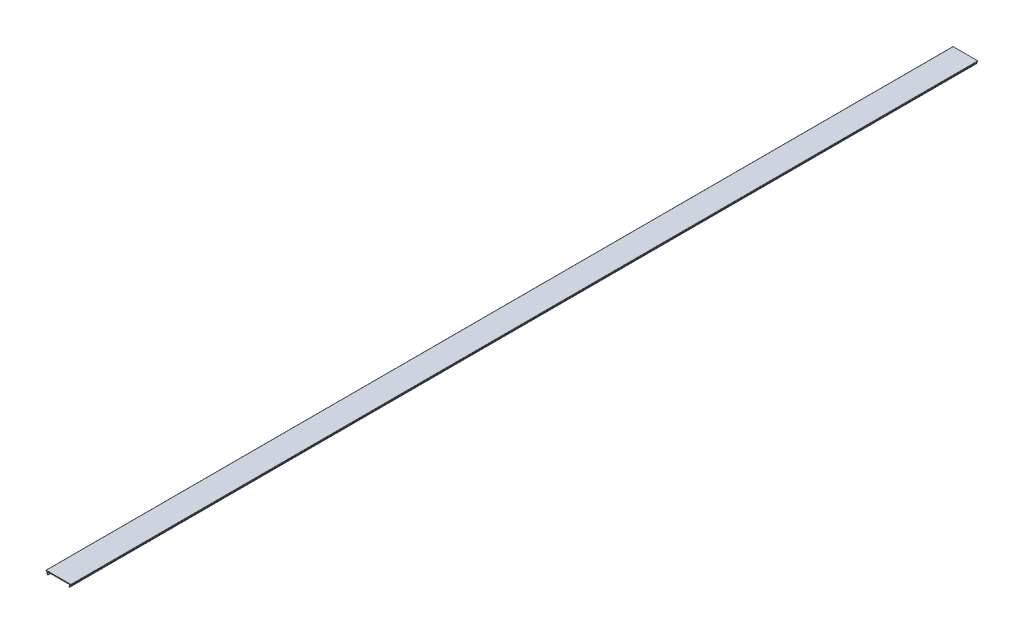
ISO-10303-21;
HEADER;
FILE_DESCRIPTION(('STEP AP214'),'2;1');
FILE_NAME('part.step','',(''),(''),'','','');
FILE_SCHEMA(('AUTOMOTIVE_DESIGN { 1 0 10303 214 1 1 1 1 }'));
ENDSEC;
DATA;
#1=APPLICATION_CONTEXT('core data for automotive mechanical design processes');
#2=APPLICATION_PROTOCOL_DEFINITION('international standard','automotive_design',2000,#1);
#3=PRODUCT_CONTEXT('',#1,'mechanical');
#4=PRODUCT('Part','Part','',(#3));
#5=PRODUCT_RELATED_PRODUCT_CATEGORY('part','',(#4));
#6=PRODUCT_DEFINITION_FORMATION('','',#4);
#7=PRODUCT_DEFINITION_CONTEXT('part definition',#1,'design');
#8=PRODUCT_DEFINITION('design','',#6,#7);
#9=PRODUCT_DEFINITION_SHAPE('','',#8);
#10=(LENGTH_UNIT() NAMED_UNIT(*) SI_UNIT(.MILLI.,.METRE.));
#11=(NAMED_UNIT(*) PLANE_ANGLE_UNIT() SI_UNIT($,.RADIAN.));
#12=(NAMED_UNIT(*) SI_UNIT($,.STERADIAN.) SOLID_ANGLE_UNIT());
#13=UNCERTAINTY_MEASURE_WITH_UNIT(LENGTH_MEASURE(1.E-05),#10,'distance_accuracy_value','');
#14=(GEOMETRIC_REPRESENTATION_CONTEXT(3) GLOBAL_UNCERTAINTY_ASSIGNED_CONTEXT((#13)) GLOBAL_UNIT_ASSIGNED_CONTEXT((#10,
#11,#12)) REPRESENTATION_CONTEXT('',''));
#15=CARTESIAN_POINT('',(0.,0.,0.));
#16=DIRECTION('',(0.,0.,1.));
#17=DIRECTION('',(1.,0.,0.));
#18=AXIS2_PLACEMENT_3D('',#15,#16,#17);
#19=CARTESIAN_POINT('',(20.1,-2.0173731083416,-813.0032));
#20=DIRECTION('',(-0.866025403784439,0.5,0.));
#21=DIRECTION('',(-0.5,-0.866025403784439,0.));
#22=AXIS2_PLACEMENT_3D('',#19,#20,#21);
#23=PLANE('',#22);
#24=DIRECTION('',(0.,0.,1.));
#25=VECTOR('',#24,1.);
#26=CARTESIAN_POINT('',(18.810992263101,-4.24999999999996,-813.0032));
#27=LINE('',#26,#25);
#28=CARTESIAN_POINT('',(18.810992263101,-4.24999999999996,-813.0032));
#29=VERTEX_POINT('',#28);
#30=CARTESIAN_POINT('',(18.810992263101,-4.24999999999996,813.0032));
#31=VERTEX_POINT('',#30);
#32=EDGE_CURVE('E33',#29,#31,#27,.T.);
#33=ORIENTED_EDGE('',*,*,#32,.T.);
#34=DIRECTION('',(-0.5,-0.866025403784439,0.));
#35=VECTOR('',#34,1.);
#36=CARTESIAN_POINT('',(20.1,-2.0173731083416,813.0032));
#37=LINE('',#36,#35);
#38=CARTESIAN_POINT('',(20.1,-2.0173731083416,813.0032));
#39=VERTEX_POINT('',#38);
#40=EDGE_CURVE('E238',#39,#31,#37,.T.);
#41=ORIENTED_EDGE('',*,*,#40,.F.);
#42=DIRECTION('',(0.,0.,1.));
#43=VECTOR('',#42,1.);
#44=CARTESIAN_POINT('',(20.1,-2.0173731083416,-813.0032));
#45=LINE('',#44,#43);
#46=CARTESIAN_POINT('',(20.1,-2.0173731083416,-813.0032));
#47=VERTEX_POINT('',#46);
#48=EDGE_CURVE('E11',#47,#39,#45,.T.);
#49=ORIENTED_EDGE('',*,*,#48,.F.);
#50=DIRECTION('',(-0.5,-0.866025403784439,0.));
#51=VECTOR('',#50,1.);
#52=CARTESIAN_POINT('',(20.1,-2.0173731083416,-813.0032));
#53=LINE('',#52,#51);
#54=EDGE_CURVE('E239',#47,#29,#53,.T.);
#55=ORIENTED_EDGE('',*,*,#54,.T.);
#56=EDGE_LOOP('',(#33,#41,#49,#55));
#57=FACE_BOUND('',#56,.T.);
#58=ADVANCED_FACE('F30',(#57),#23,.T.);
#59=CARTESIAN_POINT('',(19.533955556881,-1.34278760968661,-813.0032));
#60=DIRECTION('',(-0.766044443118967,-0.642787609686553,0.));
#61=DIRECTION('',(0.642787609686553,-0.766044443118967,0.));
#62=AXIS2_PLACEMENT_3D('',#59,#60,#61);
#63=PLANE('',#62);
#64=ORIENTED_EDGE('',*,*,#48,.T.);
#65=DIRECTION('',(0.642787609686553,-0.766044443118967,0.));
#66=VECTOR('',#65,1.);
#67=CARTESIAN_POINT('',(19.533955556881,-1.34278760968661,813.0032));
#68=LINE('',#67,#66);
#69=CARTESIAN_POINT('',(19.533955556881,-1.34278760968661,813.0032));
#70=VERTEX_POINT('',#69);
#71=EDGE_CURVE('E256',#70,#39,#68,.T.);
#72=ORIENTED_EDGE('',*,*,#71,.F.);
#73=DIRECTION('',(0.,0.,1.));
#74=VECTOR('',#73,1.);
#75=CARTESIAN_POINT('',(19.533955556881,-1.34278760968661,-813.0032));
#76=LINE('',#75,#74);
#77=CARTESIAN_POINT('',(19.533955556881,-1.34278760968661,-813.0032));
#78=VERTEX_POINT('',#77);
#79=EDGE_CURVE('E38',#78,#70,#76,.T.);
#80=ORIENTED_EDGE('',*,*,#79,.F.);
#81=DIRECTION('',(0.642787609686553,-0.766044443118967,0.));
#82=VECTOR('',#81,1.);
#83=CARTESIAN_POINT('',(19.533955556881,-1.34278760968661,-813.0032));
#84=LINE('',#83,#82);
#85=EDGE_CURVE('E244',#78,#47,#84,.T.);
#86=ORIENTED_EDGE('',*,*,#85,.T.);
#87=EDGE_LOOP('',(#64,#72,#80,#86));
#88=FACE_BOUND('',#87,.T.);
#89=ADVANCED_FACE('F608',(#88),#63,.T.);
#90=CARTESIAN_POINT('',(20.3,-0.700000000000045,-813.0032));
#91=DIRECTION('',(0.,0.,1.));
#92=DIRECTION('',(1.,0.,0.));
#93=AXIS2_PLACEMENT_3D('',#90,#91,#92);
#94=CYLINDRICAL_SURFACE('',#93,1.00000000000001);
#95=ORIENTED_EDGE('',*,*,#79,.T.);
#96=CARTESIAN_POINT('',(20.3,-0.700000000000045,813.0032));
#97=DIRECTION('',(0.,0.,1.));
#98=DIRECTION('',(1.,0.,0.));
#99=AXIS2_PLACEMENT_3D('',#96,#97,#98);
#100=CIRCLE('',#99,1.00000000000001);
#101=CARTESIAN_POINT('',(19.3,-0.700000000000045,813.0032));
#102=VERTEX_POINT('',#101);
#103=EDGE_CURVE('E341',#102,#70,#100,.T.);
#104=ORIENTED_EDGE('',*,*,#103,.F.);
#105=DIRECTION('',(0.,0.,1.));
#106=VECTOR('',#105,1.);
#107=CARTESIAN_POINT('',(19.3,-0.700000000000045,-813.0032));
#108=LINE('',#107,#106);
#109=CARTESIAN_POINT('',(19.3,-0.700000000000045,-813.0032));
#110=VERTEX_POINT('',#109);
#111=EDGE_CURVE('E435',#110,#102,#108,.T.);
#112=ORIENTED_EDGE('',*,*,#111,.F.);
#113=CARTESIAN_POINT('',(20.3,-0.700000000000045,-813.0032));
#114=DIRECTION('',(0.,0.,1.));
#115=DIRECTION('',(1.,0.,0.));
#116=AXIS2_PLACEMENT_3D('',#113,#114,#115);
#117=CIRCLE('',#116,1.00000000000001);
#118=EDGE_CURVE('E431',#110,#78,#117,.T.);
#119=ORIENTED_EDGE('',*,*,#118,.T.);
#120=EDGE_LOOP('',(#95,#104,#112,#119));
#121=FACE_BOUND('',#120,.T.);
#122=ADVANCED_FACE('F607',(#121),#94,.T.);
#123=CARTESIAN_POINT('',(19.3,0.,-813.0032));
#124=DIRECTION('',(-1.,0.,0.));
#125=DIRECTION('',(0.,0.,1.));
#126=AXIS2_PLACEMENT_3D('',#123,#124,#125);
#127=PLANE('',#126);
#128=ORIENTED_EDGE('',*,*,#111,.T.);
#129=DIRECTION('',(0.,-1.,0.));
#130=VECTOR('',#129,1.);
#131=CARTESIAN_POINT('',(19.3,0.,813.0032));
#132=LINE('',#131,#130);
#133=CARTESIAN_POINT('',(19.3,0.,813.0032));
#134=VERTEX_POINT('',#133);
#135=EDGE_CURVE('E338',#134,#102,#132,.T.);
#136=ORIENTED_EDGE('',*,*,#135,.F.);
#137=DIRECTION('',(0.,0.,1.));
#138=VECTOR('',#137,1.);
#139=CARTESIAN_POINT('',(19.3,0.,-813.0032));
#140=LINE('',#139,#138);
#141=CARTESIAN_POINT('',(19.3,0.,-813.0032));
#142=VERTEX_POINT('',#141);
#143=EDGE_CURVE('E437',#142,#134,#140,.T.);
#144=ORIENTED_EDGE('',*,*,#143,.F.);
#145=DIRECTION('',(0.,-1.,0.));
#146=VECTOR('',#145,1.);
#147=CARTESIAN_POINT('',(19.3,0.,-813.0032));
#148=LINE('',#147,#146);
#149=EDGE_CURVE('E428',#142,#110,#148,.T.);
#150=ORIENTED_EDGE('',*,*,#149,.T.);
#151=EDGE_LOOP('',(#128,#136,#144,#150));
#152=FACE_BOUND('',#151,.T.);
#153=ADVANCED_FACE('F603',(#152),#127,.T.);
#154=CARTESIAN_POINT('',(17.5,0.,-813.0032));
#155=DIRECTION('',(0.,-1.,0.));
#156=DIRECTION('',(1.,0.,0.));
#157=AXIS2_PLACEMENT_3D('',#154,#155,#156);
#158=PLANE('',#157);
#159=ORIENTED_EDGE('',*,*,#143,.T.);
#160=DIRECTION('',(1.,0.,0.));
#161=VECTOR('',#160,1.);
#162=CARTESIAN_POINT('',(17.5,0.,813.0032));
#163=LINE('',#162,#161);
#164=CARTESIAN_POINT('',(17.5,0.,813.0032));
#165=VERTEX_POINT('',#164);
#166=EDGE_CURVE('E335',#165,#134,#163,.T.);
#167=ORIENTED_EDGE('',*,*,#166,.F.);
#168=DIRECTION('',(0.,0.,1.));
#169=VECTOR('',#168,1.);
#170=CARTESIAN_POINT('',(17.5,0.,-813.0032));
#171=LINE('',#170,#169);
#172=CARTESIAN_POINT('',(17.5,0.,-813.0032));
#173=VERTEX_POINT('',#172);
#174=EDGE_CURVE('E439',#173,#165,#171,.T.);
#175=ORIENTED_EDGE('',*,*,#174,.F.);
#176=DIRECTION('',(1.,0.,0.));
#177=VECTOR('',#176,1.);
#178=CARTESIAN_POINT('',(17.5,0.,-813.0032));
#179=LINE('',#178,#177);
#180=EDGE_CURVE('E425',#173,#142,#179,.T.);
#181=ORIENTED_EDGE('',*,*,#180,.T.);
#182=EDGE_LOOP('',(#159,#167,#175,#181));
#183=FACE_BOUND('',#182,.T.);
#184=ADVANCED_FACE('F598',(#183),#158,.T.);
#185=CARTESIAN_POINT('',(17.,-0.500000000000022,-813.0032));
#186=DIRECTION('',(0.70710678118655,-0.707106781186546,0.));
#187=DIRECTION('',(0.707106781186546,0.70710678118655,0.));
#188=AXIS2_PLACEMENT_3D('',#185,#186,#187);
#189=PLANE('',#188);
#190=ORIENTED_EDGE('',*,*,#174,.T.);
#191=DIRECTION('',(0.707106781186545,0.70710678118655,0.));
#192=VECTOR('',#191,1.);
#193=CARTESIAN_POINT('',(17.,-0.500000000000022,813.0032));
#194=LINE('',#193,#192);
#195=CARTESIAN_POINT('',(17.,-0.500000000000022,813.0032));
#196=VERTEX_POINT('',#195);
#197=EDGE_CURVE('E332',#196,#165,#194,.T.);
#198=ORIENTED_EDGE('',*,*,#197,.F.);
#199=DIRECTION('',(0.,0.,1.));
#200=VECTOR('',#199,1.);
#201=CARTESIAN_POINT('',(17.,-0.500000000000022,-813.0032));
#202=LINE('',#201,#200);
#203=CARTESIAN_POINT('',(17.,-0.500000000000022,-813.0032));
#204=VERTEX_POINT('',#203);
#205=EDGE_CURVE('E441',#204,#196,#202,.T.);
#206=ORIENTED_EDGE('',*,*,#205,.F.);
#207=DIRECTION('',(0.707106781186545,0.70710678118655,0.));
#208=VECTOR('',#207,1.);
#209=CARTESIAN_POINT('',(17.,-0.500000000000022,-813.0032));
#210=LINE('',#209,#208);
#211=EDGE_CURVE('E422',#204,#173,#210,.T.);
#212=ORIENTED_EDGE('',*,*,#211,.T.);
#213=EDGE_LOOP('',(#190,#198,#206,#212));
#214=FACE_BOUND('',#213,.T.);
#215=ADVANCED_FACE('F596',(#214),#189,.T.);
#216=CARTESIAN_POINT('',(-17.,-0.500000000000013,-813.0032));
#217=DIRECTION('',(0.,-1.,0.));
#218=DIRECTION('',(1.,0.,0.));
#219=AXIS2_PLACEMENT_3D('',#216,#217,#218);
#220=PLANE('',#219);
#221=ORIENTED_EDGE('',*,*,#205,.T.);
#222=DIRECTION('',(1.,0.,0.));
#223=VECTOR('',#222,1.);
#224=CARTESIAN_POINT('',(-17.,-0.500000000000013,813.0032));
#225=LINE('',#224,#223);
#226=CARTESIAN_POINT('',(-17.,-0.500000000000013,813.0032));
#227=VERTEX_POINT('',#226);
#228=EDGE_CURVE('E329',#227,#196,#225,.T.);
#229=ORIENTED_EDGE('',*,*,#228,.F.);
#230=DIRECTION('',(0.,0.,1.));
#231=VECTOR('',#230,1.);
#232=CARTESIAN_POINT('',(-17.,-0.500000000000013,-813.0032));
#233=LINE('',#232,#231);
#234=CARTESIAN_POINT('',(-17.,-0.500000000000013,-813.0032));
#235=VERTEX_POINT('',#234);
#236=EDGE_CURVE('E443',#235,#227,#233,.T.);
#237=ORIENTED_EDGE('',*,*,#236,.F.);
#238=DIRECTION('',(1.,0.,0.));
#239=VECTOR('',#238,1.);
#240=CARTESIAN_POINT('',(-17.,-0.500000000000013,-813.0032));
#241=LINE('',#240,#239);
#242=EDGE_CURVE('E419',#235,#204,#241,.T.);
#243=ORIENTED_EDGE('',*,*,#242,.T.);
#244=EDGE_LOOP('',(#221,#229,#237,#243));
#245=FACE_BOUND('',#244,.T.);
#246=ADVANCED_FACE('F591',(#245),#220,.T.);
#247=CARTESIAN_POINT('',(-17.5,0.,-813.0032));
#248=DIRECTION('',(-0.70710678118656,-0.707106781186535,0.));
#249=DIRECTION('',(0.707106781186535,-0.70710678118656,0.));
#250=AXIS2_PLACEMENT_3D('',#247,#248,#249);
#251=PLANE('',#250);
#252=ORIENTED_EDGE('',*,*,#236,.T.);
#253=DIRECTION('',(0.707106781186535,-0.70710678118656,0.));
#254=VECTOR('',#253,1.);
#255=CARTESIAN_POINT('',(-17.5,0.,813.0032));
#256=LINE('',#255,#254);
#257=CARTESIAN_POINT('',(-17.5,0.,813.0032));
#258=VERTEX_POINT('',#257);
#259=EDGE_CURVE('E326',#258,#227,#256,.T.);
#260=ORIENTED_EDGE('',*,*,#259,.F.);
#261=DIRECTION('',(0.,0.,1.));
#262=VECTOR('',#261,1.);
#263=CARTESIAN_POINT('',(-17.5,0.,-813.0032));
#264=LINE('',#263,#262);
#265=CARTESIAN_POINT('',(-17.5,0.,-813.0032));
#266=VERTEX_POINT('',#265);
#267=EDGE_CURVE('E445',#266,#258,#264,.T.);
#268=ORIENTED_EDGE('',*,*,#267,.F.);
#269=DIRECTION('',(0.707106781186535,-0.70710678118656,0.));
#270=VECTOR('',#269,1.);
#271=CARTESIAN_POINT('',(-17.5,0.,-813.0032));
#272=LINE('',#271,#270);
#273=EDGE_CURVE('E416',#266,#235,#272,.T.);
#274=ORIENTED_EDGE('',*,*,#273,.T.);
#275=EDGE_LOOP('',(#252,#260,#268,#274));
#276=FACE_BOUND('',#275,.T.);
#277=ADVANCED_FACE('F586',(#276),#251,.T.);
#278=CARTESIAN_POINT('',(-19.3,0.,-813.0032));
#279=DIRECTION('',(0.,-1.,0.));
#280=DIRECTION('',(1.,0.,0.));
#281=AXIS2_PLACEMENT_3D('',#278,#279,#280);
#282=PLANE('',#281);
#283=ORIENTED_EDGE('',*,*,#267,.T.);
#284=DIRECTION('',(1.,0.,0.));
#285=VECTOR('',#284,1.);
#286=CARTESIAN_POINT('',(-19.3,0.,813.0032));
#287=LINE('',#286,#285);
#288=CARTESIAN_POINT('',(-19.3,0.,813.0032));
#289=VERTEX_POINT('',#288);
#290=EDGE_CURVE('E323',#289,#258,#287,.T.);
#291=ORIENTED_EDGE('',*,*,#290,.F.);
#292=DIRECTION('',(0.,0.,1.));
#293=VECTOR('',#292,1.);
#294=CARTESIAN_POINT('',(-19.3,0.,-813.0032));
#295=LINE('',#294,#293);
#296=CARTESIAN_POINT('',(-19.3,0.,-813.0032));
#297=VERTEX_POINT('',#296);
#298=EDGE_CURVE('E447',#297,#289,#295,.T.);
#299=ORIENTED_EDGE('',*,*,#298,.F.);
#300=DIRECTION('',(1.,0.,0.));
#301=VECTOR('',#300,1.);
#302=CARTESIAN_POINT('',(-19.3,0.,-813.0032));
#303=LINE('',#302,#301);
#304=EDGE_CURVE('E413',#297,#266,#303,.T.);
#305=ORIENTED_EDGE('',*,*,#304,.T.);
#306=EDGE_LOOP('',(#283,#291,#299,#305));
#307=FACE_BOUND('',#306,.T.);
#308=ADVANCED_FACE('F584',(#307),#282,.T.);
#309=CARTESIAN_POINT('',(-19.3,-0.700000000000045,-813.0032));
#310=DIRECTION('',(1.,0.,0.));
#311=DIRECTION('',(0.,1.,0.));
#312=AXIS2_PLACEMENT_3D('',#309,#310,#311);
#313=PLANE('',#312);
#314=ORIENTED_EDGE('',*,*,#298,.T.);
#315=DIRECTION('',(0.,1.,0.));
#316=VECTOR('',#315,1.);
#317=CARTESIAN_POINT('',(-19.3,-0.700000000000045,813.0032));
#318=LINE('',#317,#316);
#319=CARTESIAN_POINT('',(-19.3,-0.700000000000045,813.0032));
#320=VERTEX_POINT('',#319);
#321=EDGE_CURVE('E320',#320,#289,#318,.T.);
#322=ORIENTED_EDGE('',*,*,#321,.F.);
#323=DIRECTION('',(0.,0.,1.));
#324=VECTOR('',#323,1.);
#325=CARTESIAN_POINT('',(-19.3,-0.700000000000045,-813.0032));
#326=LINE('',#325,#324);
#327=CARTESIAN_POINT('',(-19.3,-0.700000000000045,-813.0032));
#328=VERTEX_POINT('',#327);
#329=EDGE_CURVE('E449',#328,#320,#326,.T.);
#330=ORIENTED_EDGE('',*,*,#329,.F.);
#331=DIRECTION('',(0.,1.,0.));
#332=VECTOR('',#331,1.);
#333=CARTESIAN_POINT('',(-19.3,-0.700000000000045,-813.0032));
#334=LINE('',#333,#332);
#335=EDGE_CURVE('E410',#328,#297,#334,.T.);
#336=ORIENTED_EDGE('',*,*,#335,.T.);
#337=EDGE_LOOP('',(#314,#322,#330,#336));
#338=FACE_BOUND('',#337,.T.);
#339=ADVANCED_FACE('F579',(#338),#313,.T.);
#340=CARTESIAN_POINT('',(-20.3,-0.700000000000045,-813.0032));
#341=DIRECTION('',(0.,0.,1.));
#342=DIRECTION('',(1.,0.,0.));
#343=AXIS2_PLACEMENT_3D('',#340,#341,#342);
#344=CYLINDRICAL_SURFACE('',#343,0.999999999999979);
#345=ORIENTED_EDGE('',*,*,#329,.T.);
#346=CARTESIAN_POINT('',(-20.3,-0.700000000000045,813.0032));
#347=DIRECTION('',(0.,0.,1.));
#348=DIRECTION('',(1.,0.,0.));
#349=AXIS2_PLACEMENT_3D('',#346,#347,#348);
#350=CIRCLE('',#349,0.999999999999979);
#351=CARTESIAN_POINT('',(-19.533955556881,-1.34278760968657,813.0032));
#352=VERTEX_POINT('',#351);
#353=EDGE_CURVE('E317',#352,#320,#350,.T.);
#354=ORIENTED_EDGE('',*,*,#353,.F.);
#355=DIRECTION('',(0.,0.,1.));
#356=VECTOR('',#355,1.);
#357=CARTESIAN_POINT('',(-19.533955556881,-1.34278760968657,-813.0032));
#358=LINE('',#357,#356);
#359=CARTESIAN_POINT('',(-19.533955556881,-1.34278760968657,-813.0032));
#360=VERTEX_POINT('',#359);
#361=EDGE_CURVE('E451',#360,#352,#358,.T.);
#362=ORIENTED_EDGE('',*,*,#361,.F.);
#363=CARTESIAN_POINT('',(-20.3,-0.700000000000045,-813.0032));
#364=DIRECTION('',(0.,0.,1.));
#365=DIRECTION('',(1.,0.,0.));
#366=AXIS2_PLACEMENT_3D('',#363,#364,#365);
#367=CIRCLE('',#366,0.999999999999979);
#368=EDGE_CURVE('E407',#360,#328,#367,.T.);
#369=ORIENTED_EDGE('',*,*,#368,.T.);
#370=EDGE_LOOP('',(#345,#354,#362,#369));
#371=FACE_BOUND('',#370,.T.);
#372=ADVANCED_FACE('F574',(#371),#344,.T.);
#373=CARTESIAN_POINT('',(-20.1,-2.0173731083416,-813.0032));
#374=DIRECTION('',(0.766044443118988,-0.642787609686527,0.));
#375=DIRECTION('',(0.642787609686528,0.766044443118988,0.));
#376=AXIS2_PLACEMENT_3D('',#373,#374,#375);
#377=PLANE('',#376);
#378=ORIENTED_EDGE('',*,*,#361,.T.);
#379=DIRECTION('',(0.642787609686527,0.766044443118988,0.));
#380=VECTOR('',#379,1.);
#381=CARTESIAN_POINT('',(-20.1,-2.0173731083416,813.0032));
#382=LINE('',#381,#380);
#383=CARTESIAN_POINT('',(-20.1,-2.0173731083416,813.0032));
#384=VERTEX_POINT('',#383);
#385=EDGE_CURVE('E314',#384,#352,#382,.T.);
#386=ORIENTED_EDGE('',*,*,#385,.F.);
#387=DIRECTION('',(0.,0.,1.));
#388=VECTOR('',#387,1.);
#389=CARTESIAN_POINT('',(-20.1,-2.0173731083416,-813.0032));
#390=LINE('',#389,#388);
#391=CARTESIAN_POINT('',(-20.1,-2.0173731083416,-813.0032));
#392=VERTEX_POINT('',#391);
#393=EDGE_CURVE('E453',#392,#384,#390,.T.);
#394=ORIENTED_EDGE('',*,*,#393,.F.);
#395=DIRECTION('',(0.642787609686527,0.766044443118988,0.));
#396=VECTOR('',#395,1.);
#397=CARTESIAN_POINT('',(-20.1,-2.0173731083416,-813.0032));
#398=LINE('',#397,#396);
#399=EDGE_CURVE('E404',#392,#360,#398,.T.);
#400=ORIENTED_EDGE('',*,*,#399,.T.);
#401=EDGE_LOOP('',(#378,#386,#394,#400));
#402=FACE_BOUND('',#401,.T.);
#403=ADVANCED_FACE('F572',(#402),#377,.T.);
#404=CARTESIAN_POINT('',(-18.810992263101,-4.24999999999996,-813.0032));
#405=DIRECTION('',(0.866025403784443,0.499999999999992,0.));
#406=DIRECTION('',(-0.499999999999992,0.866025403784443,0.));
#407=AXIS2_PLACEMENT_3D('',#404,#405,#406);
#408=PLANE('',#407);
#409=ORIENTED_EDGE('',*,*,#393,.T.);
#410=DIRECTION('',(-0.499999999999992,0.866025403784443,0.));
#411=VECTOR('',#410,1.);
#412=CARTESIAN_POINT('',(-18.810992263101,-4.24999999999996,813.0032));
#413=LINE('',#412,#411);
#414=CARTESIAN_POINT('',(-18.810992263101,-4.24999999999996,813.0032));
#415=VERTEX_POINT('',#414);
#416=EDGE_CURVE('E311',#415,#384,#413,.T.);
#417=ORIENTED_EDGE('',*,*,#416,.F.);
#418=DIRECTION('',(0.,0.,1.));
#419=VECTOR('',#418,1.);
#420=CARTESIAN_POINT('',(-18.810992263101,-4.24999999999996,-813.0032));
#421=LINE('',#420,#419);
#422=CARTESIAN_POINT('',(-18.810992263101,-4.24999999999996,-813.0032));
#423=VERTEX_POINT('',#422);
#424=EDGE_CURVE('E455',#423,#415,#421,.T.);
#425=ORIENTED_EDGE('',*,*,#424,.F.);
#426=DIRECTION('',(-0.499999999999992,0.866025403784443,0.));
#427=VECTOR('',#426,1.);
#428=CARTESIAN_POINT('',(-18.810992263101,-4.24999999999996,-813.0032));
#429=LINE('',#428,#427);
#430=EDGE_CURVE('E401',#423,#392,#429,.T.);
#431=ORIENTED_EDGE('',*,*,#430,.T.);
#432=EDGE_LOOP('',(#409,#417,#425,#431));
#433=FACE_BOUND('',#432,.T.);
#434=ADVANCED_FACE('F567',(#433),#408,.T.);
#435=CARTESIAN_POINT('',(-19.2440049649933,-4.49999999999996,-813.0032));
#436=DIRECTION('',(0.,0.,1.));
#437=DIRECTION('',(1.,0.,0.));
#438=AXIS2_PLACEMENT_3D('',#435,#436,#437);
#439=CYLINDRICAL_SURFACE('',#438,0.500000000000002);
#440=ORIENTED_EDGE('',*,*,#424,.T.);
#441=CARTESIAN_POINT('',(-19.2440049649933,-4.49999999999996,813.0032));
#442=DIRECTION('',(0.,0.,1.));
#443=DIRECTION('',(1.,0.,0.));
#444=AXIS2_PLACEMENT_3D('',#441,#442,#443);
#445=CIRCLE('',#444,0.500000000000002);
#446=CARTESIAN_POINT('',(-19.6770176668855,-4.74999999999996,813.0032));
#447=VERTEX_POINT('',#446);
#448=EDGE_CURVE('E308',#447,#415,#445,.T.);
#449=ORIENTED_EDGE('',*,*,#448,.F.);
#450=DIRECTION('',(0.,0.,1.));
#451=VECTOR('',#450,1.);
#452=CARTESIAN_POINT('',(-19.6770176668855,-4.74999999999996,-813.0032));
#453=LINE('',#452,#451);
#454=CARTESIAN_POINT('',(-19.6770176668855,-4.74999999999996,-813.0032));
#455=VERTEX_POINT('',#454);
#456=EDGE_CURVE('E457',#455,#447,#453,.T.);
#457=ORIENTED_EDGE('',*,*,#456,.F.);
#458=CARTESIAN_POINT('',(-19.2440049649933,-4.49999999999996,-813.0032));
#459=DIRECTION('',(0.,0.,1.));
#460=DIRECTION('',(1.,0.,0.));
#461=AXIS2_PLACEMENT_3D('',#458,#459,#460);
#462=CIRCLE('',#461,0.500000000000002);
#463=EDGE_CURVE('E398',#455,#423,#462,.T.);
#464=ORIENTED_EDGE('',*,*,#463,.T.);
#465=EDGE_LOOP('',(#440,#449,#457,#464));
#466=FACE_BOUND('',#465,.T.);
#467=ADVANCED_FACE('F562',(#466),#439,.T.);
#468=CARTESIAN_POINT('',(-20.9660254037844,-2.51737310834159,-813.0032));
#469=DIRECTION('',(-0.866025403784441,-0.499999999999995,0.));
#470=DIRECTION('',(0.499999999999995,-0.866025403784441,0.));
#471=AXIS2_PLACEMENT_3D('',#468,#469,#470);
#472=PLANE('',#471);
#473=ORIENTED_EDGE('',*,*,#456,.T.);
#474=DIRECTION('',(0.499999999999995,-0.866025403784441,0.));
#475=VECTOR('',#474,1.);
#476=CARTESIAN_POINT('',(-20.9660254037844,-2.51737310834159,813.0032));
#477=LINE('',#476,#475);
#478=CARTESIAN_POINT('',(-20.9660254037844,-2.51737310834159,813.0032));
#479=VERTEX_POINT('',#478);
#480=EDGE_CURVE('E305',#479,#447,#477,.T.);
#481=ORIENTED_EDGE('',*,*,#480,.F.);
#482=DIRECTION('',(0.,0.,1.));
#483=VECTOR('',#482,1.);
#484=CARTESIAN_POINT('',(-20.9660254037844,-2.51737310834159,-813.0032));
#485=LINE('',#484,#483);
#486=CARTESIAN_POINT('',(-20.9660254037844,-2.51737310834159,-813.0032));
#487=VERTEX_POINT('',#486);
#488=EDGE_CURVE('E459',#487,#479,#485,.T.);
#489=ORIENTED_EDGE('',*,*,#488,.F.);
#490=DIRECTION('',(0.499999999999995,-0.866025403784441,0.));
#491=VECTOR('',#490,1.);
#492=CARTESIAN_POINT('',(-20.9660254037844,-2.51737310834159,-813.0032));
#493=LINE('',#492,#491);
#494=EDGE_CURVE('E395',#487,#455,#493,.T.);
#495=ORIENTED_EDGE('',*,*,#494,.T.);
#496=EDGE_LOOP('',(#473,#481,#489,#495));
#497=FACE_BOUND('',#496,.T.);
#498=ADVANCED_FACE('F560',(#497),#472,.T.);
#499=CARTESIAN_POINT('',(-20.1,-2.0173731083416,-813.0032));
#500=DIRECTION('',(0.,0.,1.));
#501=DIRECTION('',(1.,0.,0.));
#502=AXIS2_PLACEMENT_3D('',#499,#500,#501);
#503=CYLINDRICAL_SURFACE('',#502,0.999999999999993);
#504=ORIENTED_EDGE('',*,*,#488,.T.);
#505=CARTESIAN_POINT('',(-20.1,-2.0173731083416,813.0032));
#506=DIRECTION('',(0.,0.,1.));
#507=DIRECTION('',(1.,0.,0.));
#508=AXIS2_PLACEMENT_3D('',#505,#506,#507);
#509=CIRCLE('',#508,0.999999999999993);
#510=CARTESIAN_POINT('',(-20.866044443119,-1.37458549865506,813.0032));
#511=VERTEX_POINT('',#510);
#512=EDGE_CURVE('E302',#511,#479,#509,.T.);
#513=ORIENTED_EDGE('',*,*,#512,.F.);
#514=DIRECTION('',(0.,0.,1.));
#515=VECTOR('',#514,1.);
#516=CARTESIAN_POINT('',(-20.866044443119,-1.37458549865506,-813.0032));
#517=LINE('',#516,#515);
#518=CARTESIAN_POINT('',(-20.866044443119,-1.37458549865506,-813.0032));
#519=VERTEX_POINT('',#518);
#520=EDGE_CURVE('E461',#519,#511,#517,.T.);
#521=ORIENTED_EDGE('',*,*,#520,.F.);
#522=CARTESIAN_POINT('',(-20.1,-2.0173731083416,-813.0032));
#523=DIRECTION('',(0.,0.,1.));
#524=DIRECTION('',(1.,0.,0.));
#525=AXIS2_PLACEMENT_3D('',#522,#523,#524);
#526=CIRCLE('',#525,0.999999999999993);
#527=EDGE_CURVE('E392',#519,#487,#526,.T.);
#528=ORIENTED_EDGE('',*,*,#527,.T.);
#529=EDGE_LOOP('',(#504,#513,#521,#528));
#530=FACE_BOUND('',#529,.T.);
#531=ADVANCED_FACE('F555',(#530),#503,.T.);
#532=CARTESIAN_POINT('',(-20.3,-0.700000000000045,-813.0032));
#533=DIRECTION('',(-0.766044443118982,0.642787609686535,0.));
#534=DIRECTION('',(-0.642787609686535,-0.766044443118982,0.));
#535=AXIS2_PLACEMENT_3D('',#532,#533,#534);
#536=PLANE('',#535);
#537=ORIENTED_EDGE('',*,*,#520,.T.);
#538=DIRECTION('',(-0.642787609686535,-0.766044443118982,0.));
#539=VECTOR('',#538,1.);
#540=CARTESIAN_POINT('',(-20.3,-0.700000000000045,813.0032));
#541=LINE('',#540,#539);
#542=CARTESIAN_POINT('',(-20.3,-0.700000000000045,813.0032));
#543=VERTEX_POINT('',#542);
#544=EDGE_CURVE('E299',#543,#511,#541,.T.);
#545=ORIENTED_EDGE('',*,*,#544,.F.);
#546=DIRECTION('',(0.,0.,1.));
#547=VECTOR('',#546,1.);
#548=CARTESIAN_POINT('',(-20.3,-0.700000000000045,-813.0032));
#549=LINE('',#548,#547);
#550=CARTESIAN_POINT('',(-20.3,-0.700000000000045,-813.0032));
#551=VERTEX_POINT('',#550);
#552=EDGE_CURVE('E463',#551,#543,#549,.T.);
#553=ORIENTED_EDGE('',*,*,#552,.F.);
#554=DIRECTION('',(-0.642787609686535,-0.766044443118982,0.));
#555=VECTOR('',#554,1.);
#556=CARTESIAN_POINT('',(-20.3,-0.700000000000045,-813.0032));
#557=LINE('',#556,#555);
#558=EDGE_CURVE('E389',#551,#519,#557,.T.);
#559=ORIENTED_EDGE('',*,*,#558,.T.);
#560=EDGE_LOOP('',(#537,#545,#553,#559));
#561=FACE_BOUND('',#560,.T.);
#562=ADVANCED_FACE('F550',(#561),#536,.T.);
#563=CARTESIAN_POINT('',(-20.3,0.,-813.0032));
#564=DIRECTION('',(-1.,0.,0.));
#565=DIRECTION('',(0.,0.,1.));
#566=AXIS2_PLACEMENT_3D('',#563,#564,#565);
#567=PLANE('',#566);
#568=ORIENTED_EDGE('',*,*,#552,.T.);
#569=DIRECTION('',(0.,-1.,0.));
#570=VECTOR('',#569,1.);
#571=CARTESIAN_POINT('',(-20.3,0.,813.0032));
#572=LINE('',#571,#570);
#573=CARTESIAN_POINT('',(-20.3,0.,813.0032));
#574=VERTEX_POINT('',#573);
#575=EDGE_CURVE('E296',#574,#543,#572,.T.);
#576=ORIENTED_EDGE('',*,*,#575,.F.);
#577=DIRECTION('',(0.,0.,1.));
#578=VECTOR('',#577,1.);
#579=CARTESIAN_POINT('',(-20.3,0.,-813.0032));
#580=LINE('',#579,#578);
#581=CARTESIAN_POINT('',(-20.3,0.,-813.0032));
#582=VERTEX_POINT('',#581);
#583=EDGE_CURVE('E465',#582,#574,#580,.T.);
#584=ORIENTED_EDGE('',*,*,#583,.F.);
#585=DIRECTION('',(0.,-1.,0.));
#586=VECTOR('',#585,1.);
#587=CARTESIAN_POINT('',(-20.3,0.,-813.0032));
#588=LINE('',#587,#586);
#589=EDGE_CURVE('E386',#582,#551,#588,.T.);
#590=ORIENTED_EDGE('',*,*,#589,.T.);
#591=EDGE_LOOP('',(#568,#576,#584,#590));
#592=FACE_BOUND('',#591,.T.);
#593=ADVANCED_FACE('F548',(#592),#567,.T.);
#594=CARTESIAN_POINT('',(-22.3,0.,-813.0032));
#595=DIRECTION('',(0.,-1.,0.));
#596=DIRECTION('',(1.,0.,0.));
#597=AXIS2_PLACEMENT_3D('',#594,#595,#596);
#598=PLANE('',#597);
#599=ORIENTED_EDGE('',*,*,#583,.T.);
#600=DIRECTION('',(1.,0.,0.));
#601=VECTOR('',#600,1.);
#602=CARTESIAN_POINT('',(-22.3,0.,813.0032));
#603=LINE('',#602,#601);
#604=CARTESIAN_POINT('',(-22.3,0.,813.0032));
#605=VERTEX_POINT('',#604);
#606=EDGE_CURVE('E293',#605,#574,#603,.T.);
#607=ORIENTED_EDGE('',*,*,#606,.F.);
#608=DIRECTION('',(0.,0.,1.));
#609=VECTOR('',#608,1.);
#610=CARTESIAN_POINT('',(-22.3,0.,-813.0032));
#611=LINE('',#610,#609);
#612=CARTESIAN_POINT('',(-22.3,0.,-813.0032));
#613=VERTEX_POINT('',#612);
#614=EDGE_CURVE('E467',#613,#605,#611,.T.);
#615=ORIENTED_EDGE('',*,*,#614,.F.);
#616=DIRECTION('',(1.,0.,0.));
#617=VECTOR('',#616,1.);
#618=CARTESIAN_POINT('',(-22.3,0.,-813.0032));
#619=LINE('',#618,#617);
#620=EDGE_CURVE('E383',#613,#582,#619,.T.);
#621=ORIENTED_EDGE('',*,*,#620,.T.);
#622=EDGE_LOOP('',(#599,#607,#615,#621));
#623=FACE_BOUND('',#622,.T.);
#624=ADVANCED_FACE('F543',(#623),#598,.T.);
#625=CARTESIAN_POINT('',(-22.3,0.200000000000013,-813.0032));
#626=DIRECTION('',(0.,0.,1.));
#627=DIRECTION('',(1.,0.,0.));
#628=AXIS2_PLACEMENT_3D('',#625,#626,#627);
#629=CYLINDRICAL_SURFACE('',#628,0.200000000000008);
#630=ORIENTED_EDGE('',*,*,#614,.T.);
#631=CARTESIAN_POINT('',(-22.3,0.200000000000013,813.0032));
#632=DIRECTION('',(0.,0.,1.));
#633=DIRECTION('',(1.,0.,0.));
#634=AXIS2_PLACEMENT_3D('',#631,#632,#633);
#635=CIRCLE('',#634,0.200000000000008);
#636=CARTESIAN_POINT('',(-22.5,0.200000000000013,813.0032));
#637=VERTEX_POINT('',#636);
#638=EDGE_CURVE('E290',#637,#605,#635,.T.);
#639=ORIENTED_EDGE('',*,*,#638,.F.);
#640=DIRECTION('',(0.,0.,1.));
#641=VECTOR('',#640,1.);
#642=CARTESIAN_POINT('',(-22.5,0.200000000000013,-813.0032));
#643=LINE('',#642,#641);
#644=CARTESIAN_POINT('',(-22.5,0.200000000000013,-813.0032));
#645=VERTEX_POINT('',#644);
#646=EDGE_CURVE('E469',#645,#637,#643,.T.);
#647=ORIENTED_EDGE('',*,*,#646,.F.);
#648=CARTESIAN_POINT('',(-22.3,0.200000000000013,-813.0032));
#649=DIRECTION('',(0.,0.,1.));
#650=DIRECTION('',(1.,0.,0.));
#651=AXIS2_PLACEMENT_3D('',#648,#649,#650);
#652=CIRCLE('',#651,0.200000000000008);
#653=EDGE_CURVE('E380',#645,#613,#652,.T.);
#654=ORIENTED_EDGE('',*,*,#653,.T.);
#655=EDGE_LOOP('',(#630,#639,#647,#654));
#656=FACE_BOUND('',#655,.T.);
#657=ADVANCED_FACE('F538',(#656),#629,.T.);
#658=CARTESIAN_POINT('',(-22.5,0.500000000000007,-813.0032));
#659=DIRECTION('',(-1.,0.,0.));
#660=DIRECTION('',(0.,0.,1.));
#661=AXIS2_PLACEMENT_3D('',#658,#659,#660);
#662=PLANE('',#661);
#663=ORIENTED_EDGE('',*,*,#646,.T.);
#664=DIRECTION('',(0.,-1.,0.));
#665=VECTOR('',#664,1.);
#666=CARTESIAN_POINT('',(-22.5,0.500000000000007,813.0032));
#667=LINE('',#666,#665);
#668=CARTESIAN_POINT('',(-22.5,0.500000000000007,813.0032));
#669=VERTEX_POINT('',#668);
#670=EDGE_CURVE('E287',#669,#637,#667,.T.);
#671=ORIENTED_EDGE('',*,*,#670,.F.);
#672=DIRECTION('',(0.,0.,1.));
#673=VECTOR('',#672,1.);
#674=CARTESIAN_POINT('',(-22.5,0.500000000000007,-813.0032));
#675=LINE('',#674,#673);
#676=CARTESIAN_POINT('',(-22.5,0.500000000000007,-813.0032));
#677=VERTEX_POINT('',#676);
#678=EDGE_CURVE('E471',#677,#669,#675,.T.);
#679=ORIENTED_EDGE('',*,*,#678,.F.);
#680=DIRECTION('',(0.,-1.,0.));
#681=VECTOR('',#680,1.);
#682=CARTESIAN_POINT('',(-22.5,0.500000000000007,-813.0032));
#683=LINE('',#682,#681);
#684=EDGE_CURVE('E377',#677,#645,#683,.T.);
#685=ORIENTED_EDGE('',*,*,#684,.T.);
#686=EDGE_LOOP('',(#663,#671,#679,#685));
#687=FACE_BOUND('',#686,.T.);
#688=ADVANCED_FACE('F536',(#687),#662,.T.);
#689=CARTESIAN_POINT('',(-22.,0.500000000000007,-813.0032));
#690=DIRECTION('',(0.,0.,1.));
#691=DIRECTION('',(1.,0.,0.));
#692=AXIS2_PLACEMENT_3D('',#689,#690,#691);
#693=CYLINDRICAL_SURFACE('',#692,0.500000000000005);
#694=ORIENTED_EDGE('',*,*,#678,.T.);
#695=CARTESIAN_POINT('',(-22.,0.500000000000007,813.0032));
#696=DIRECTION('',(0.,0.,1.));
#697=DIRECTION('',(1.,0.,0.));
#698=AXIS2_PLACEMENT_3D('',#695,#696,#697);
#699=CIRCLE('',#698,0.500000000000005);
#700=CARTESIAN_POINT('',(-22.,1.00000000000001,813.0032));
#701=VERTEX_POINT('',#700);
#702=EDGE_CURVE('E284',#701,#669,#699,.T.);
#703=ORIENTED_EDGE('',*,*,#702,.F.);
#704=DIRECTION('',(0.,0.,1.));
#705=VECTOR('',#704,1.);
#706=CARTESIAN_POINT('',(-22.,1.00000000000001,-813.0032));
#707=LINE('',#706,#705);
#708=CARTESIAN_POINT('',(-22.,1.00000000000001,-813.0032));
#709=VERTEX_POINT('',#708);
#710=EDGE_CURVE('E473',#709,#701,#707,.T.);
#711=ORIENTED_EDGE('',*,*,#710,.F.);
#712=CARTESIAN_POINT('',(-22.,0.500000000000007,-813.0032));
#713=DIRECTION('',(0.,0.,1.));
#714=DIRECTION('',(1.,0.,0.));
#715=AXIS2_PLACEMENT_3D('',#712,#713,#714);
#716=CIRCLE('',#715,0.500000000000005);
#717=EDGE_CURVE('E374',#709,#677,#716,.T.);
#718=ORIENTED_EDGE('',*,*,#717,.T.);
#719=EDGE_LOOP('',(#694,#703,#711,#718));
#720=FACE_BOUND('',#719,.T.);
#721=ADVANCED_FACE('F531',(#720),#693,.T.);
#722=CARTESIAN_POINT('',(22.,1.00000000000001,-813.0032));
#723=DIRECTION('',(0.,1.,0.));
#724=DIRECTION('',(-1.,0.,0.));
#725=AXIS2_PLACEMENT_3D('',#722,#723,#724);
#726=PLANE('',#725);
#727=ORIENTED_EDGE('',*,*,#710,.T.);
#728=DIRECTION('',(-1.,0.,0.));
#729=VECTOR('',#728,1.);
#730=CARTESIAN_POINT('',(22.,1.00000000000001,813.0032));
#731=LINE('',#730,#729);
#732=CARTESIAN_POINT('',(22.,1.00000000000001,813.0032));
#733=VERTEX_POINT('',#732);
#734=EDGE_CURVE('E281',#733,#701,#731,.T.);
#735=ORIENTED_EDGE('',*,*,#734,.F.);
#736=DIRECTION('',(0.,0.,1.));
#737=VECTOR('',#736,1.);
#738=CARTESIAN_POINT('',(22.,1.00000000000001,-813.0032));
#739=LINE('',#738,#737);
#740=CARTESIAN_POINT('',(22.,1.00000000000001,-813.0032));
#741=VERTEX_POINT('',#740);
#742=EDGE_CURVE('E475',#741,#733,#739,.T.);
#743=ORIENTED_EDGE('',*,*,#742,.F.);
#744=DIRECTION('',(-1.,0.,0.));
#745=VECTOR('',#744,1.);
#746=CARTESIAN_POINT('',(22.,1.00000000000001,-813.0032));
#747=LINE('',#746,#745);
#748=EDGE_CURVE('E371',#741,#709,#747,.T.);
#749=ORIENTED_EDGE('',*,*,#748,.T.);
#750=EDGE_LOOP('',(#727,#735,#743,#749));
#751=FACE_BOUND('',#750,.T.);
#752=ADVANCED_FACE('F526',(#751),#726,.T.);
#753=CARTESIAN_POINT('',(22.,0.500000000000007,-813.0032));
#754=DIRECTION('',(0.,0.,1.));
#755=DIRECTION('',(1.,0.,0.));
#756=AXIS2_PLACEMENT_3D('',#753,#754,#755);
#757=CYLINDRICAL_SURFACE('',#756,0.500000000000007);
#758=ORIENTED_EDGE('',*,*,#742,.T.);
#759=CARTESIAN_POINT('',(22.,0.500000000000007,813.0032));
#760=DIRECTION('',(0.,0.,1.));
#761=DIRECTION('',(1.,0.,0.));
#762=AXIS2_PLACEMENT_3D('',#759,#760,#761);
#763=CIRCLE('',#762,0.500000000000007);
#764=CARTESIAN_POINT('',(22.5,0.500000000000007,813.0032));
#765=VERTEX_POINT('',#764);
#766=EDGE_CURVE('E278',#765,#733,#763,.T.);
#767=ORIENTED_EDGE('',*,*,#766,.F.);
#768=DIRECTION('',(0.,0.,1.));
#769=VECTOR('',#768,1.);
#770=CARTESIAN_POINT('',(22.5,0.500000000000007,-813.0032));
#771=LINE('',#770,#769);
#772=CARTESIAN_POINT('',(22.5,0.500000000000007,-813.0032));
#773=VERTEX_POINT('',#772);
#774=EDGE_CURVE('E477',#773,#765,#771,.T.);
#775=ORIENTED_EDGE('',*,*,#774,.F.);
#776=CARTESIAN_POINT('',(22.,0.500000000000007,-813.0032));
#777=DIRECTION('',(0.,0.,1.));
#778=DIRECTION('',(1.,0.,0.));
#779=AXIS2_PLACEMENT_3D('',#776,#777,#778);
#780=CIRCLE('',#779,0.500000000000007);
#781=EDGE_CURVE('E368',#773,#741,#780,.T.);
#782=ORIENTED_EDGE('',*,*,#781,.T.);
#783=EDGE_LOOP('',(#758,#767,#775,#782));
#784=FACE_BOUND('',#783,.T.);
#785=ADVANCED_FACE('F524',(#784),#757,.T.);
#786=CARTESIAN_POINT('',(22.5,0.200000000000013,-813.0032));
#787=DIRECTION('',(1.,0.,0.));
#788=DIRECTION('',(0.,1.,0.));
#789=AXIS2_PLACEMENT_3D('',#786,#787,#788);
#790=PLANE('',#789);
#791=ORIENTED_EDGE('',*,*,#774,.T.);
#792=DIRECTION('',(0.,1.,0.));
#793=VECTOR('',#792,1.);
#794=CARTESIAN_POINT('',(22.5,0.200000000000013,813.0032));
#795=LINE('',#794,#793);
#796=CARTESIAN_POINT('',(22.5,0.200000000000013,813.0032));
#797=VERTEX_POINT('',#796);
#798=EDGE_CURVE('E275',#797,#765,#795,.T.);
#799=ORIENTED_EDGE('',*,*,#798,.F.);
#800=DIRECTION('',(0.,0.,1.));
#801=VECTOR('',#800,1.);
#802=CARTESIAN_POINT('',(22.5,0.200000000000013,-813.0032));
#803=LINE('',#802,#801);
#804=CARTESIAN_POINT('',(22.5,0.200000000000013,-813.0032));
#805=VERTEX_POINT('',#804);
#806=EDGE_CURVE('E479',#805,#797,#803,.T.);
#807=ORIENTED_EDGE('',*,*,#806,.F.);
#808=DIRECTION('',(0.,1.,0.));
#809=VECTOR('',#808,1.);
#810=CARTESIAN_POINT('',(22.5,0.200000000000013,-813.0032));
#811=LINE('',#810,#809);
#812=EDGE_CURVE('E365',#805,#773,#811,.T.);
#813=ORIENTED_EDGE('',*,*,#812,.T.);
#814=EDGE_LOOP('',(#791,#799,#807,#813));
#815=FACE_BOUND('',#814,.T.);
#816=ADVANCED_FACE('F519',(#815),#790,.T.);
#817=CARTESIAN_POINT('',(22.3,0.200000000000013,-813.0032));
#818=DIRECTION('',(0.,0.,1.));
#819=DIRECTION('',(1.,0.,0.));
#820=AXIS2_PLACEMENT_3D('',#817,#818,#819);
#821=CYLINDRICAL_SURFACE('',#820,0.200000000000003);
#822=ORIENTED_EDGE('',*,*,#806,.T.);
#823=CARTESIAN_POINT('',(22.3,0.200000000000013,813.0032));
#824=DIRECTION('',(0.,0.,1.));
#825=DIRECTION('',(1.,0.,0.));
#826=AXIS2_PLACEMENT_3D('',#823,#824,#825);
#827=CIRCLE('',#826,0.200000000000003);
#828=CARTESIAN_POINT('',(22.3,0.,813.0032));
#829=VERTEX_POINT('',#828);
#830=EDGE_CURVE('E272',#829,#797,#827,.T.);
#831=ORIENTED_EDGE('',*,*,#830,.F.);
#832=DIRECTION('',(0.,0.,1.));
#833=VECTOR('',#832,1.);
#834=CARTESIAN_POINT('',(22.3,0.,-813.0032));
#835=LINE('',#834,#833);
#836=CARTESIAN_POINT('',(22.3,0.,-813.0032));
#837=VERTEX_POINT('',#836);
#838=EDGE_CURVE('E481',#837,#829,#835,.T.);
#839=ORIENTED_EDGE('',*,*,#838,.F.);
#840=CARTESIAN_POINT('',(22.3,0.200000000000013,-813.0032));
#841=DIRECTION('',(0.,0.,1.));
#842=DIRECTION('',(1.,0.,0.));
#843=AXIS2_PLACEMENT_3D('',#840,#841,#842);
#844=CIRCLE('',#843,0.200000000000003);
#845=EDGE_CURVE('E362',#837,#805,#844,.T.);
#846=ORIENTED_EDGE('',*,*,#845,.T.);
#847=EDGE_LOOP('',(#822,#831,#839,#846));
#848=FACE_BOUND('',#847,.T.);
#849=ADVANCED_FACE('F514',(#848),#821,.T.);
#850=CARTESIAN_POINT('',(20.3,0.,-813.0032));
#851=DIRECTION('',(0.,-1.,0.));
#852=DIRECTION('',(1.,0.,0.));
#853=AXIS2_PLACEMENT_3D('',#850,#851,#852);
#854=PLANE('',#853);
#855=ORIENTED_EDGE('',*,*,#838,.T.);
#856=DIRECTION('',(1.,0.,0.));
#857=VECTOR('',#856,1.);
#858=CARTESIAN_POINT('',(20.3,0.,813.0032));
#859=LINE('',#858,#857);
#860=CARTESIAN_POINT('',(20.3,0.,813.0032));
#861=VERTEX_POINT('',#860);
#862=EDGE_CURVE('E269',#861,#829,#859,.T.);
#863=ORIENTED_EDGE('',*,*,#862,.F.);
#864=DIRECTION('',(0.,0.,1.));
#865=VECTOR('',#864,1.);
#866=CARTESIAN_POINT('',(20.3,0.,-813.0032));
#867=LINE('',#866,#865);
#868=CARTESIAN_POINT('',(20.3,0.,-813.0032));
#869=VERTEX_POINT('',#868);
#870=EDGE_CURVE('E483',#869,#861,#867,.T.);
#871=ORIENTED_EDGE('',*,*,#870,.F.);
#872=DIRECTION('',(1.,0.,0.));
#873=VECTOR('',#872,1.);
#874=CARTESIAN_POINT('',(20.3,0.,-813.0032));
#875=LINE('',#874,#873);
#876=EDGE_CURVE('E359',#869,#837,#875,.T.);
#877=ORIENTED_EDGE('',*,*,#876,.T.);
#878=EDGE_LOOP('',(#855,#863,#871,#877));
#879=FACE_BOUND('',#878,.T.);
#880=ADVANCED_FACE('F512',(#879),#854,.T.);
#881=CARTESIAN_POINT('',(20.3,-0.700000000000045,-813.0032));
#882=DIRECTION('',(1.,0.,0.));
#883=DIRECTION('',(0.,0.,-1.));
#884=AXIS2_PLACEMENT_3D('',#881,#882,#883);
#885=PLANE('',#884);
#886=ORIENTED_EDGE('',*,*,#870,.T.);
#887=DIRECTION('',(0.,1.,0.));
#888=VECTOR('',#887,1.);
#889=CARTESIAN_POINT('',(20.3,-0.700000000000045,813.0032));
#890=LINE('',#889,#888);
#891=CARTESIAN_POINT('',(20.3,-0.700000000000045,813.0032));
#892=VERTEX_POINT('',#891);
#893=EDGE_CURVE('E266',#892,#861,#890,.T.);
#894=ORIENTED_EDGE('',*,*,#893,.F.);
#895=DIRECTION('',(0.,0.,1.));
#896=VECTOR('',#895,1.);
#897=CARTESIAN_POINT('',(20.3,-0.700000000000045,-813.0032));
#898=LINE('',#897,#896);
#899=CARTESIAN_POINT('',(20.3,-0.700000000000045,-813.0032));
#900=VERTEX_POINT('',#899);
#901=EDGE_CURVE('E485',#900,#892,#898,.T.);
#902=ORIENTED_EDGE('',*,*,#901,.F.);
#903=DIRECTION('',(0.,1.,0.));
#904=VECTOR('',#903,1.);
#905=CARTESIAN_POINT('',(20.3,-0.700000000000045,-813.0032));
#906=LINE('',#905,#904);
#907=EDGE_CURVE('E356',#900,#869,#906,.T.);
#908=ORIENTED_EDGE('',*,*,#907,.T.);
#909=EDGE_LOOP('',(#886,#894,#902,#908));
#910=FACE_BOUND('',#909,.T.);
#911=ADVANCED_FACE('F507',(#910),#885,.T.);
#912=CARTESIAN_POINT('',(20.866044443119,-1.37458549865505,-813.0032));
#913=DIRECTION('',(0.766044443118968,0.642787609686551,0.));
#914=DIRECTION('',(-0.642787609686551,0.766044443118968,0.));
#915=AXIS2_PLACEMENT_3D('',#912,#913,#914);
#916=PLANE('',#915);
#917=ORIENTED_EDGE('',*,*,#901,.T.);
#918=DIRECTION('',(-0.642787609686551,0.766044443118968,0.));
#919=VECTOR('',#918,1.);
#920=CARTESIAN_POINT('',(20.866044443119,-1.37458549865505,813.0032));
#921=LINE('',#920,#919);
#922=CARTESIAN_POINT('',(20.866044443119,-1.37458549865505,813.0032));
#923=VERTEX_POINT('',#922);
#924=EDGE_CURVE('E263',#923,#892,#921,.T.);
#925=ORIENTED_EDGE('',*,*,#924,.F.);
#926=DIRECTION('',(0.,0.,1.));
#927=VECTOR('',#926,1.);
#928=CARTESIAN_POINT('',(20.866044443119,-1.37458549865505,-813.0032));
#929=LINE('',#928,#927);
#930=CARTESIAN_POINT('',(20.866044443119,-1.37458549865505,-813.0032));
#931=VERTEX_POINT('',#930);
#932=EDGE_CURVE('E487',#931,#923,#929,.T.);
#933=ORIENTED_EDGE('',*,*,#932,.F.);
#934=DIRECTION('',(-0.642787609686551,0.766044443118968,0.));
#935=VECTOR('',#934,1.);
#936=CARTESIAN_POINT('',(20.866044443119,-1.37458549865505,-813.0032));
#937=LINE('',#936,#935);
#938=EDGE_CURVE('E353',#931,#900,#937,.T.);
#939=ORIENTED_EDGE('',*,*,#938,.T.);
#940=EDGE_LOOP('',(#917,#925,#933,#939));
#941=FACE_BOUND('',#940,.T.);
#942=ADVANCED_FACE('F500',(#941),#916,.T.);
#943=CARTESIAN_POINT('',(20.1,-2.0173731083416,-813.0032));
#944=DIRECTION('',(0.,0.,1.));
#945=DIRECTION('',(1.,0.,0.));
#946=AXIS2_PLACEMENT_3D('',#943,#944,#945);
#947=CYLINDRICAL_SURFACE('',#946,1.00000000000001);
#948=ORIENTED_EDGE('',*,*,#932,.T.);
#949=CARTESIAN_POINT('',(20.1,-2.0173731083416,813.0032));
#950=DIRECTION('',(0.,0.,1.));
#951=DIRECTION('',(1.,0.,0.));
#952=AXIS2_PLACEMENT_3D('',#949,#950,#951);
#953=CIRCLE('',#952,1.00000000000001);
#954=CARTESIAN_POINT('',(20.9660254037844,-2.51737310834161,813.0032));
#955=VERTEX_POINT('',#954);
#956=EDGE_CURVE('E260',#955,#923,#953,.T.);
#957=ORIENTED_EDGE('',*,*,#956,.F.);
#958=DIRECTION('',(0.,0.,1.));
#959=VECTOR('',#958,1.);
#960=CARTESIAN_POINT('',(20.9660254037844,-2.51737310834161,-813.0032));
#961=LINE('',#960,#959);
#962=CARTESIAN_POINT('',(20.9660254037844,-2.51737310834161,-813.0032));
#963=VERTEX_POINT('',#962);
#964=EDGE_CURVE('E489',#963,#955,#961,.T.);
#965=ORIENTED_EDGE('',*,*,#964,.F.);
#966=CARTESIAN_POINT('',(20.1,-2.0173731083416,-813.0032));
#967=DIRECTION('',(0.,0.,1.));
#968=DIRECTION('',(1.,0.,0.));
#969=AXIS2_PLACEMENT_3D('',#966,#967,#968);
#970=CIRCLE('',#969,1.00000000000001);
#971=EDGE_CURVE('E350',#963,#931,#970,.T.);
#972=ORIENTED_EDGE('',*,*,#971,.T.);
#973=EDGE_LOOP('',(#948,#957,#965,#972));
#974=FACE_BOUND('',#973,.T.);
#975=ADVANCED_FACE('F497',(#974),#947,.T.);
#976=CARTESIAN_POINT('',(19.6770176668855,-4.74999999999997,-813.0032));
#977=DIRECTION('',(0.866025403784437,-0.500000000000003,0.));
#978=DIRECTION('',(0.500000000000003,0.866025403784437,0.));
#979=AXIS2_PLACEMENT_3D('',#976,#977,#978);
#980=PLANE('',#979);
#981=ORIENTED_EDGE('',*,*,#964,.T.);
#982=DIRECTION('',(0.500000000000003,0.866025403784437,0.));
#983=VECTOR('',#982,1.);
#984=CARTESIAN_POINT('',(19.6770176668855,-4.74999999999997,813.0032));
#985=LINE('',#984,#983);
#986=CARTESIAN_POINT('',(19.6770176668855,-4.74999999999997,813.0032));
#987=VERTEX_POINT('',#986);
#988=EDGE_CURVE('E251',#987,#955,#985,.T.);
#989=ORIENTED_EDGE('',*,*,#988,.F.);
#990=DIRECTION('',(0.,0.,1.));
#991=VECTOR('',#990,1.);
#992=CARTESIAN_POINT('',(19.6770176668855,-4.74999999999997,-813.0032));
#993=LINE('',#992,#991);
#994=CARTESIAN_POINT('',(19.6770176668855,-4.74999999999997,-813.0032));
#995=VERTEX_POINT('',#994);
#996=EDGE_CURVE('E243',#995,#987,#993,.T.);
#997=ORIENTED_EDGE('',*,*,#996,.F.);
#998=DIRECTION('',(0.500000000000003,0.866025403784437,0.));
#999=VECTOR('',#998,1.);
#1000=CARTESIAN_POINT('',(19.6770176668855,-4.74999999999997,-813.0032));
#1001=LINE('',#1000,#999);
#1002=EDGE_CURVE('E347',#995,#963,#1001,.T.);
#1003=ORIENTED_EDGE('',*,*,#1002,.T.);
#1004=EDGE_LOOP('',(#981,#989,#997,#1003));
#1005=FACE_BOUND('',#1004,.T.);
#1006=ADVANCED_FACE('F491',(#1005),#980,.T.);
#1007=CARTESIAN_POINT('',(19.2440049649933,-4.49999999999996,-813.0032));
#1008=DIRECTION('',(0.,0.,1.));
#1009=DIRECTION('',(1.,0.,0.));
#1010=AXIS2_PLACEMENT_3D('',#1007,#1008,#1009);
#1011=CYLINDRICAL_SURFACE('',#1010,0.500000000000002);
#1012=ORIENTED_EDGE('',*,*,#996,.T.);
#1013=CARTESIAN_POINT('',(19.2440049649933,-4.49999999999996,813.0032));
#1014=DIRECTION('',(0.,0.,1.));
#1015=DIRECTION('',(1.,0.,0.));
#1016=AXIS2_PLACEMENT_3D('',#1013,#1014,#1015);
#1017=CIRCLE('',#1016,0.500000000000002);
#1018=EDGE_CURVE('E246',#31,#987,#1017,.T.);
#1019=ORIENTED_EDGE('',*,*,#1018,.F.);
#1020=ORIENTED_EDGE('',*,*,#32,.F.);
#1021=CARTESIAN_POINT('',(19.2440049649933,-4.49999999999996,-813.0032));
#1022=DIRECTION('',(0.,0.,1.));
#1023=DIRECTION('',(1.,0.,0.));
#1024=AXIS2_PLACEMENT_3D('',#1021,#1022,#1023);
#1025=CIRCLE('',#1024,0.500000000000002);
#1026=EDGE_CURVE('E345',#29,#995,#1025,.T.);
#1027=ORIENTED_EDGE('',*,*,#1026,.T.);
#1028=EDGE_LOOP('',(#1012,#1019,#1020,#1027));
#1029=FACE_BOUND('',#1028,.T.);
#1030=ADVANCED_FACE('F247',(#1029),#1011,.T.);
#1031=CARTESIAN_POINT('',(19.2440049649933,-4.49999999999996,-813.0032));
#1032=DIRECTION('',(0.,0.,1.));
#1033=DIRECTION('',(1.,0.,0.));
#1034=AXIS2_PLACEMENT_3D('',#1031,#1032,#1033);
#1035=PLANE('',#1034);
#1036=ORIENTED_EDGE('',*,*,#54,.F.);
#1037=ORIENTED_EDGE('',*,*,#85,.F.);
#1038=ORIENTED_EDGE('',*,*,#118,.F.);
#1039=ORIENTED_EDGE('',*,*,#149,.F.);
#1040=ORIENTED_EDGE('',*,*,#180,.F.);
#1041=ORIENTED_EDGE('',*,*,#211,.F.);
#1042=ORIENTED_EDGE('',*,*,#242,.F.);
#1043=ORIENTED_EDGE('',*,*,#273,.F.);
#1044=ORIENTED_EDGE('',*,*,#304,.F.);
#1045=ORIENTED_EDGE('',*,*,#335,.F.);
#1046=ORIENTED_EDGE('',*,*,#368,.F.);
#1047=ORIENTED_EDGE('',*,*,#399,.F.);
#1048=ORIENTED_EDGE('',*,*,#430,.F.);
#1049=ORIENTED_EDGE('',*,*,#463,.F.);
#1050=ORIENTED_EDGE('',*,*,#494,.F.);
#1051=ORIENTED_EDGE('',*,*,#527,.F.);
#1052=ORIENTED_EDGE('',*,*,#558,.F.);
#1053=ORIENTED_EDGE('',*,*,#589,.F.);
#1054=ORIENTED_EDGE('',*,*,#620,.F.);
#1055=ORIENTED_EDGE('',*,*,#653,.F.);
#1056=ORIENTED_EDGE('',*,*,#684,.F.);
#1057=ORIENTED_EDGE('',*,*,#717,.F.);
#1058=ORIENTED_EDGE('',*,*,#748,.F.);
#1059=ORIENTED_EDGE('',*,*,#781,.F.);
#1060=ORIENTED_EDGE('',*,*,#812,.F.);
#1061=ORIENTED_EDGE('',*,*,#845,.F.);
#1062=ORIENTED_EDGE('',*,*,#876,.F.);
#1063=ORIENTED_EDGE('',*,*,#907,.F.);
#1064=ORIENTED_EDGE('',*,*,#938,.F.);
#1065=ORIENTED_EDGE('',*,*,#971,.F.);
#1066=ORIENTED_EDGE('',*,*,#1002,.F.);
#1067=ORIENTED_EDGE('',*,*,#1026,.F.);
#1068=EDGE_LOOP('',(#1036,#1037,#1038,#1039,#1040,#1041,#1042,#1043,#1044,#1045,#1046,#1047,
#1048,#1049,#1050,#1051,#1052,#1053,#1054,#1055,#1056,#1057,#1058,#1059,#1060,#1061,#1062,#1063,
#1064,#1065,#1066,#1067));
#1069=FACE_BOUND('',#1068,.T.);
#1070=ADVANCED_FACE('F503',(#1069),#1035,.F.);
#1071=CARTESIAN_POINT('',(19.2440049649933,-4.49999999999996,813.0032));
#1072=DIRECTION('',(0.,0.,1.));
#1073=DIRECTION('',(1.,0.,0.));
#1074=AXIS2_PLACEMENT_3D('',#1071,#1072,#1073);
#1075=PLANE('',#1074);
#1076=ORIENTED_EDGE('',*,*,#40,.T.);
#1077=ORIENTED_EDGE('',*,*,#1018,.T.);
#1078=ORIENTED_EDGE('',*,*,#988,.T.);
#1079=ORIENTED_EDGE('',*,*,#956,.T.);
#1080=ORIENTED_EDGE('',*,*,#924,.T.);
#1081=ORIENTED_EDGE('',*,*,#893,.T.);
#1082=ORIENTED_EDGE('',*,*,#862,.T.);
#1083=ORIENTED_EDGE('',*,*,#830,.T.);
#1084=ORIENTED_EDGE('',*,*,#798,.T.);
#1085=ORIENTED_EDGE('',*,*,#766,.T.);
#1086=ORIENTED_EDGE('',*,*,#734,.T.);
#1087=ORIENTED_EDGE('',*,*,#702,.T.);
#1088=ORIENTED_EDGE('',*,*,#670,.T.);
#1089=ORIENTED_EDGE('',*,*,#638,.T.);
#1090=ORIENTED_EDGE('',*,*,#606,.T.);
#1091=ORIENTED_EDGE('',*,*,#575,.T.);
#1092=ORIENTED_EDGE('',*,*,#544,.T.);
#1093=ORIENTED_EDGE('',*,*,#512,.T.);
#1094=ORIENTED_EDGE('',*,*,#480,.T.);
#1095=ORIENTED_EDGE('',*,*,#448,.T.);
#1096=ORIENTED_EDGE('',*,*,#416,.T.);
#1097=ORIENTED_EDGE('',*,*,#385,.T.);
#1098=ORIENTED_EDGE('',*,*,#353,.T.);
#1099=ORIENTED_EDGE('',*,*,#321,.T.);
#1100=ORIENTED_EDGE('',*,*,#290,.T.);
#1101=ORIENTED_EDGE('',*,*,#259,.T.);
#1102=ORIENTED_EDGE('',*,*,#228,.T.);
#1103=ORIENTED_EDGE('',*,*,#197,.T.);
#1104=ORIENTED_EDGE('',*,*,#166,.T.);
#1105=ORIENTED_EDGE('',*,*,#135,.T.);
#1106=ORIENTED_EDGE('',*,*,#103,.T.);
#1107=ORIENTED_EDGE('',*,*,#71,.T.);
#1108=EDGE_LOOP('',(#1076,#1077,#1078,#1079,#1080,#1081,#1082,#1083,#1084,#1085,#1086,#1087,
#1088,#1089,#1090,#1091,#1092,#1093,#1094,#1095,#1096,#1097,#1098,#1099,#1100,#1101,#1102,#1103,
#1104,#1105,#1106,#1107));
#1109=FACE_BOUND('',#1108,.T.);
#1110=ADVANCED_FACE('F254',(#1109),#1075,.T.);
#1111=CLOSED_SHELL('',(#58,#89,#122,#153,#184,#215,#246,#277,#308,#339,#372,#403,#434,#467,#498,
#531,#562,#593,#624,#657,#688,#721,#752,#785,#816,#849,#880,#911,#942,#975,#1006,#1030,#1070,#1110));
#1112=MANIFOLD_SOLID_BREP('B2',#1111);
#1113=ADVANCED_BREP_SHAPE_REPRESENTATION('',(#18,#1112),#14);
#1114=SHAPE_DEFINITION_REPRESENTATION(#9,#1113);
ENDSEC;
END-ISO-10303-21;
